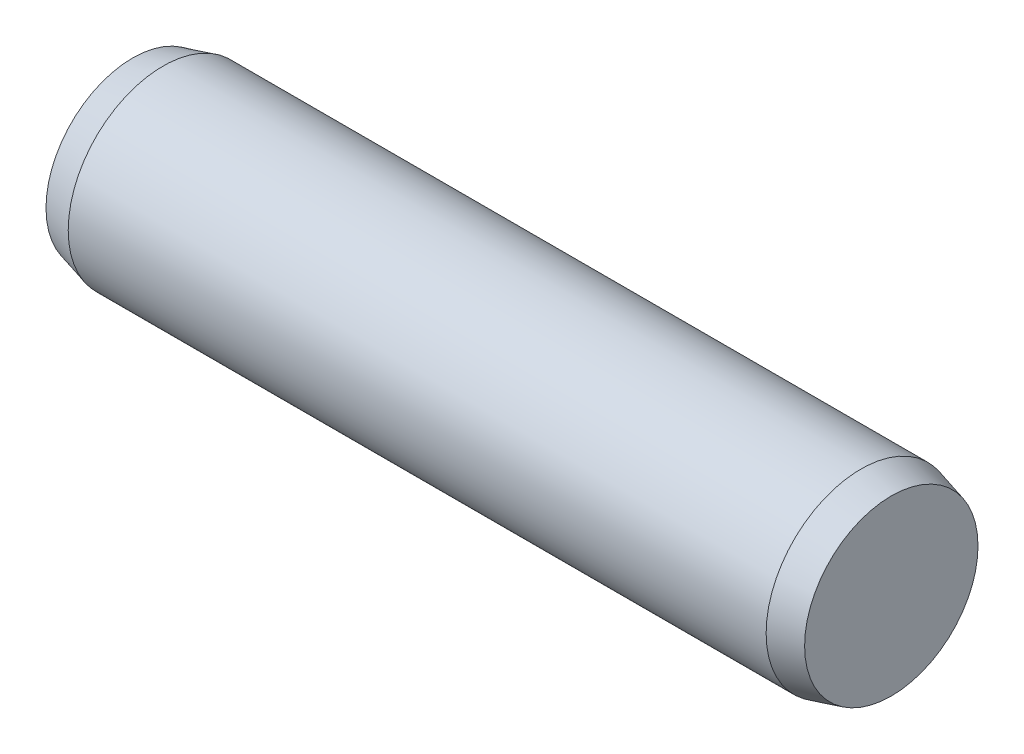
ISO-10303-21;
HEADER;
FILE_DESCRIPTION(('STEP AP214'),'2;1');
FILE_NAME('part.step','',(''),(''),'','','');
FILE_SCHEMA(('AUTOMOTIVE_DESIGN { 1 0 10303 214 1 1 1 1 }'));
ENDSEC;
DATA;
#1=APPLICATION_CONTEXT('core data for automotive mechanical design processes');
#2=APPLICATION_PROTOCOL_DEFINITION('international standard','automotive_design',2000,#1);
#3=PRODUCT_CONTEXT('',#1,'mechanical');
#4=PRODUCT('Part','Part','',(#3));
#5=PRODUCT_RELATED_PRODUCT_CATEGORY('part','',(#4));
#6=PRODUCT_DEFINITION_FORMATION('','',#4);
#7=PRODUCT_DEFINITION_CONTEXT('part definition',#1,'design');
#8=PRODUCT_DEFINITION('design','',#6,#7);
#9=PRODUCT_DEFINITION_SHAPE('','',#8);
#10=(LENGTH_UNIT() NAMED_UNIT(*) SI_UNIT(.MILLI.,.METRE.));
#11=(NAMED_UNIT(*) PLANE_ANGLE_UNIT() SI_UNIT($,.RADIAN.));
#12=(NAMED_UNIT(*) SI_UNIT($,.STERADIAN.) SOLID_ANGLE_UNIT());
#13=UNCERTAINTY_MEASURE_WITH_UNIT(LENGTH_MEASURE(1.E-05),#10,'distance_accuracy_value','');
#14=(GEOMETRIC_REPRESENTATION_CONTEXT(3) GLOBAL_UNCERTAINTY_ASSIGNED_CONTEXT((#13)) GLOBAL_UNIT_ASSIGNED_CONTEXT((#10,
#11,#12)) REPRESENTATION_CONTEXT('',''));
#15=CARTESIAN_POINT('',(0.,0.,0.));
#16=DIRECTION('',(0.,0.,1.));
#17=DIRECTION('',(1.,0.,0.));
#18=AXIS2_PLACEMENT_3D('',#15,#16,#17);
#19=CARTESIAN_POINT('',(0.,11.4282032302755,0.));
#20=DIRECTION('',(1.,0.,0.));
#21=DIRECTION('',(0.,0.,-1.));
#22=AXIS2_PLACEMENT_3D('',#19,#20,#21);
#23=PLANE('',#22);
#24=CARTESIAN_POINT('',(0.,0.,0.));
#25=DIRECTION('',(-1.,0.,0.));
#26=DIRECTION('',(0.,0.,1.));
#27=AXIS2_PLACEMENT_3D('',#24,#25,#26);
#28=CIRCLE('',#27,11.4282032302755);
#29=CARTESIAN_POINT('',(0.,0.,11.4282032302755));
#30=VERTEX_POINT('',#29);
#31=EDGE_CURVE('E45',#30,#30,#28,.T.);
#32=ORIENTED_EDGE('',*,*,#31,.T.);
#33=EDGE_LOOP('',(#32));
#34=FACE_BOUND('',#33,.T.);
#35=ADVANCED_FACE('F31',(#34),#23,.F.);
#36=CARTESIAN_POINT('',(100.,0.,0.));
#37=DIRECTION('',(-1.,0.,0.));
#38=DIRECTION('',(0.,0.,1.));
#39=AXIS2_PLACEMENT_3D('',#36,#37,#38);
#40=PLANE('',#39);
#41=CARTESIAN_POINT('',(100.,0.,0.));
#42=DIRECTION('',(-1.,0.,0.));
#43=DIRECTION('',(0.,0.,1.));
#44=AXIS2_PLACEMENT_3D('',#41,#42,#43);
#45=CIRCLE('',#44,11.4282032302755);
#46=CARTESIAN_POINT('',(100.,0.,11.4282032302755));
#47=VERTEX_POINT('',#46);
#48=EDGE_CURVE('E10',#47,#47,#45,.T.);
#49=ORIENTED_EDGE('',*,*,#48,.F.);
#50=EDGE_LOOP('',(#49));
#51=FACE_BOUND('',#50,.T.);
#52=ADVANCED_FACE('F65',(#51),#40,.F.);
#53=CARTESIAN_POINT('',(100.,0.,0.));
#54=DIRECTION('',(-1.,0.,0.));
#55=DIRECTION('',(0.,0.,1.));
#56=AXIS2_PLACEMENT_3D('',#53,#54,#55);
#57=CONICAL_SURFACE('',#56,11.4282032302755,0.26179938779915);
#58=CARTESIAN_POINT('',(96.,0.,0.));
#59=DIRECTION('',(-1.,0.,0.));
#60=DIRECTION('',(0.,0.,1.));
#61=AXIS2_PLACEMENT_3D('',#58,#59,#60);
#62=CIRCLE('',#61,12.5);
#63=CARTESIAN_POINT('',(96.,0.,12.5));
#64=VERTEX_POINT('',#63);
#65=EDGE_CURVE('E37',#64,#64,#62,.T.);
#66=ORIENTED_EDGE('',*,*,#65,.F.);
#67=EDGE_LOOP('',(#66));
#68=FACE_BOUND('',#67,.T.);
#69=ORIENTED_EDGE('',*,*,#48,.T.);
#70=EDGE_LOOP('',(#69));
#71=FACE_BOUND('',#70,.T.);
#72=ADVANCED_FACE('F60',(#68,#71),#57,.T.);
#73=CARTESIAN_POINT('',(-6.35,0.,0.));
#74=DIRECTION('',(-1.,0.,0.));
#75=DIRECTION('',(0.,0.,1.));
#76=AXIS2_PLACEMENT_3D('',#73,#74,#75);
#77=CYLINDRICAL_SURFACE('',#76,12.5);
#78=CARTESIAN_POINT('',(4.,0.,0.));
#79=DIRECTION('',(-1.,0.,0.));
#80=DIRECTION('',(0.,0.,1.));
#81=AXIS2_PLACEMENT_3D('',#78,#79,#80);
#82=CIRCLE('',#81,12.5);
#83=CARTESIAN_POINT('',(4.,0.,12.5));
#84=VERTEX_POINT('',#83);
#85=EDGE_CURVE('E41',#84,#84,#82,.T.);
#86=ORIENTED_EDGE('',*,*,#85,.F.);
#87=EDGE_LOOP('',(#86));
#88=FACE_BOUND('',#87,.T.);
#89=ORIENTED_EDGE('',*,*,#65,.T.);
#90=EDGE_LOOP('',(#89));
#91=FACE_BOUND('',#90,.T.);
#92=ADVANCED_FACE('F55',(#88,#91),#77,.T.);
#93=CARTESIAN_POINT('',(4.,0.,0.));
#94=DIRECTION('',(1.,0.,0.));
#95=DIRECTION('',(0.,0.,-1.));
#96=AXIS2_PLACEMENT_3D('',#93,#94,#95);
#97=CONICAL_SURFACE('',#96,12.5,0.261799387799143);
#98=ORIENTED_EDGE('',*,*,#31,.F.);
#99=EDGE_LOOP('',(#98));
#100=FACE_BOUND('',#99,.T.);
#101=ORIENTED_EDGE('',*,*,#85,.T.);
#102=EDGE_LOOP('',(#101));
#103=FACE_BOUND('',#102,.T.);
#104=ADVANCED_FACE('F52',(#100,#103),#97,.T.);
#105=CLOSED_SHELL('',(#35,#52,#72,#92,#104));
#106=MANIFOLD_SOLID_BREP('B2',#105);
#107=ADVANCED_BREP_SHAPE_REPRESENTATION('',(#18,#106),#14);
#108=SHAPE_DEFINITION_REPRESENTATION(#9,#107);
ENDSEC;
END-ISO-10303-21;
